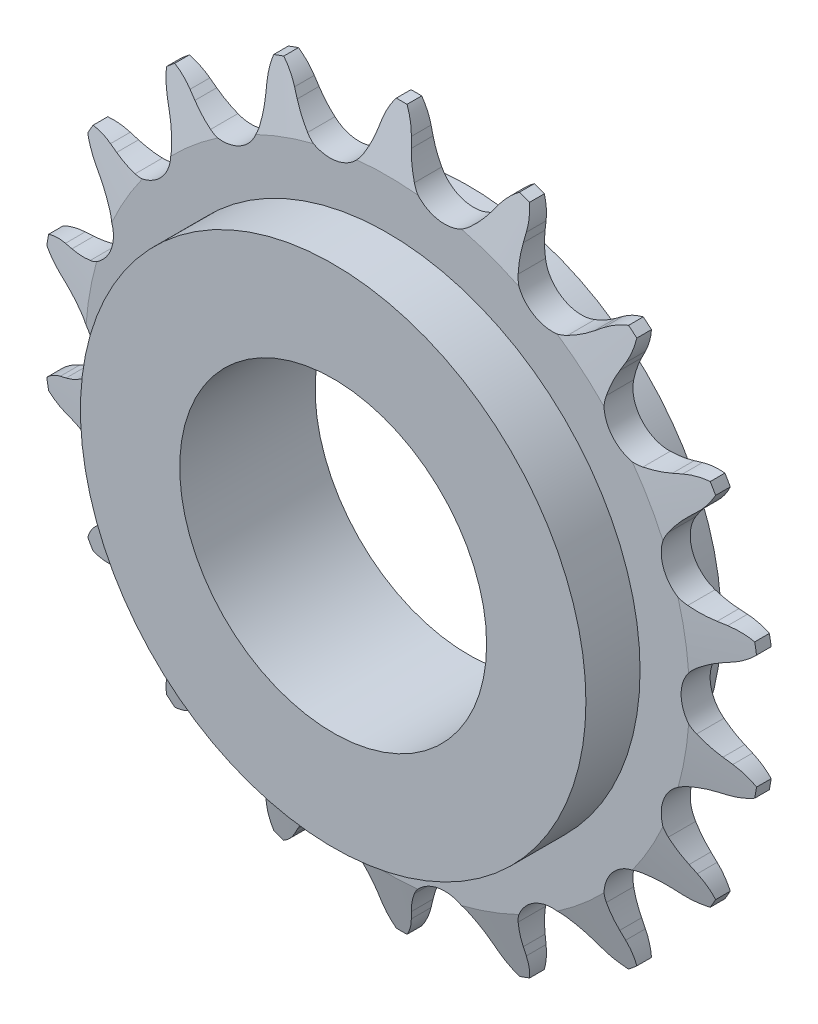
from build123d import *

# Parameters (mm, degrees)
CUT_EXTRUDE1_DEPTH       = 57.433095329
CIRPATTERN1_COUNT        = 18
CUT_EXTRUDE2_DEPTH       = 57.077204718
CUT_EXTRUDE2_DEPTH_BACK  = 57.077204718
SKETCH3_OUTSIDE_W        = 103.064
SKETCH3_OUTSIDE_H        = 104.076
SKETCH3_OUTSIDE_R        = 39.878
SKETCH3_OUTSIDE_R_2      = 7.9375
BOSS_EXTRUDE1_DEPTH      = 6
BOSS_EXTRUDE1_DEPTH_BACK = 9
SKETCH4_R                = 28
SKETCH5_R                = 17
CUT_EXTRUDE3_DEPTH       = 58.936550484
SKETCH6_R                = 44.151680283
SKETCH6_R_2              = 28
CUT_EXTRUDE4_DEPTH       = 3.999992


with BuildPart() as part:
    # Sketch1 → Revolve1 (revolve)
    with BuildSketch(Plane(origin=(0, 0, 0), x_dir=(0, 0, -1), z_dir=(1, 0, 0)), mode=Mode.PRIVATE) as revolve1_sk:
        Polygon((3.6068, 0), (-3.6068, 0), (-3.6068, 33.472639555), (-2.0193, 39.822639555), (2.0193, 39.822639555), (3.6068, 33.472639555), align=None)
    revolve(revolve1_sk.sketch.rotate(Axis((0, 0, -3.6068), (0, 0, 1)), 90), axis=Axis((0, 0, -3.6068), (0, 0, 1)))

    # Sketch0 → Cut-Extrude1 (cut, symmetric)
    with BuildSketch(Plane.XY):
        with BuildLine():
            Line((11.30390338, -35.832051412), (10.78002486, -35.038887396))
            ThreePointArc((10.78002486, -35.038887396), (9.9673727, -33.966963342), (9.022686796, -33.009365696))
            ThreePointArc((9.022686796, -33.009365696), (5.651880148, -32.053405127), (2.811315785, -34.104597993))
            ThreePointArc((2.811315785, -34.104597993), (2.251119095, -35.327547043), (1.854095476, -36.612769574))
            Line((1.854095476, -36.612769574), (1.633088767, -37.537276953))
            ThreePointArc((1.633088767, -37.537276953), (-1.028147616, -41.415236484), (-5.601279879, -42.513967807))
            ThreePointArc((-5.601279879, -42.513967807), (7.446271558, -42.229904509), (19.804114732, -38.034311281))
            ThreePointArc((19.804114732, -38.034311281), (15.130987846, -38.565944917), (11.30390338, -35.832051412))
        make_face()
    cut_extrude1 = extrude(amount=CUT_EXTRUDE1_DEPTH, both=True, mode=Mode.SUBTRACT)

    # CirPattern1: Cut-Extrude1 ×18 about axis
    cirpattern1_axis = Axis((0, 0, 0), (0, 0, 1))
    for i in range(1, CIRPATTERN1_COUNT):
        add(cut_extrude1.rotate(cirpattern1_axis, i * 360 / CIRPATTERN1_COUNT), mode=Mode.SUBTRACT)

    # Sketch3 outside → Cut-Extrude2 (cut, two sides: drawn at the far end of the back side and taken through both)
    # profile 1 of 2: a face of its own
    with BuildSketch(Plane.XY.offset(-CUT_EXTRUDE2_DEPTH_BACK)):
        Rectangle(SKETCH3_OUTSIDE_W, SKETCH3_OUTSIDE_H)
        Circle(SKETCH3_OUTSIDE_R, mode=Mode.SUBTRACT)
    # profile 2 of 2: a face of its own
    with BuildSketch(Plane.XY.offset(-CUT_EXTRUDE2_DEPTH_BACK)):
        with Locations(Location((0, 0, 0), (0, 0, 180))):
            Circle(SKETCH3_OUTSIDE_R_2)
    extrude(amount=CUT_EXTRUDE2_DEPTH + CUT_EXTRUDE2_DEPTH_BACK, mode=Mode.SUBTRACT)

    # Sketch4 → Boss-Extrude1 (add, two sides: drawn at the far end of the back side and taken through both)
    with BuildSketch(Plane.XY.offset(3.6068).offset(-BOSS_EXTRUDE1_DEPTH_BACK)):
        Circle(SKETCH4_R)
    extrude(amount=BOSS_EXTRUDE1_DEPTH + BOSS_EXTRUDE1_DEPTH_BACK)

    # Sketch5 → Cut-Extrude3 (cut, through all)
    with BuildSketch(Plane.XY.offset(9.6068)):
        Circle(SKETCH5_R)
    extrude(amount=-CUT_EXTRUDE3_DEPTH, mode=Mode.SUBTRACT)

    # Sketch6 → Cut-Extrude4 (cut)
    with BuildSketch(Plane(origin=(0, 0, -3.6068), x_dir=(-1, 0, 0), z_dir=(0, 0, -1))):
        Circle(SKETCH6_R)
        with Locations(Location((0, 0, 0), (0, 0, 180))):
            Circle(SKETCH6_R_2, mode=Mode.SUBTRACT)
    extrude(amount=-CUT_EXTRUDE4_DEPTH, mode=Mode.SUBTRACT)


solid = part.part
